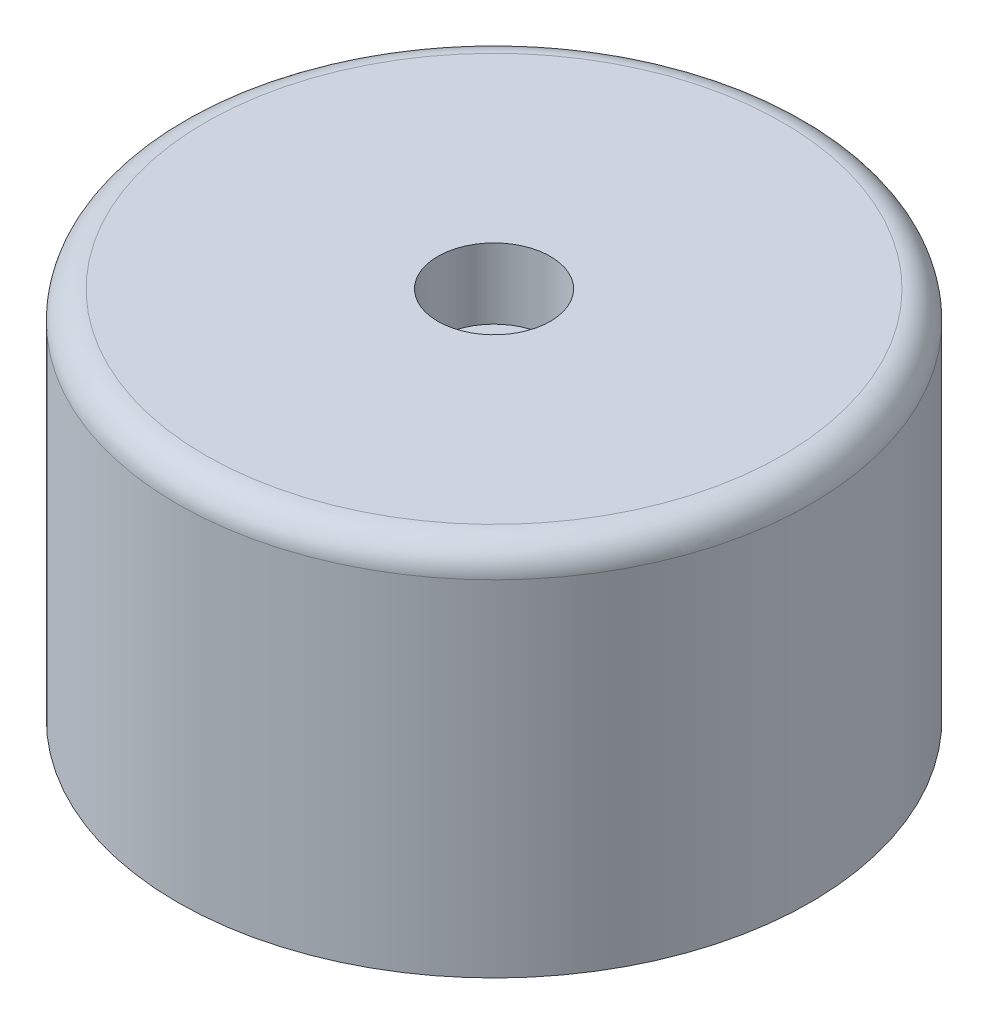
from build123d import *

# Parameters (mm, degrees)
ESQUISSE1_R             = 4.5
EXTRUSION1_DEPTH        = 5.3
CONG_1_R                = 0.4
ESQUISSE2_R             = 0.8
ENL_V_MAT_EXTRU_1_DEPTH = 1


with BuildPart() as part:
    # Esquisse1 → Extrusion1 (new body)
    with BuildSketch(Plane(origin=(0, 0, 0), x_dir=(1, 0, 0), z_dir=(0, 1, 0))):
        with Locations(Location((0, 0, 0), (0, 0, 270))):
            Circle(ESQUISSE1_R)
    extrude(amount=EXTRUSION1_DEPTH)

    # Cong_1
    cong_1_edges = [part.edges().sort_by_distance(p)[0] for p in [
        (0, 5.3, -4.5),
    ]]
    fillet(cong_1_edges, radius=CONG_1_R)

    # Esquisse2 → Enl_v. mat.-Extru.1 (cut)
    with BuildSketch(Plane(origin=(0, 5.3, 0), x_dir=(-1, 0, 0), z_dir=(0, 1, 0))):
        with Locations(Location((0, 0, 0), (0, 0, 90))):
            Circle(ESQUISSE2_R)
    extrude(amount=-ENL_V_MAT_EXTRU_1_DEPTH, mode=Mode.SUBTRACT)


solid = part.part
